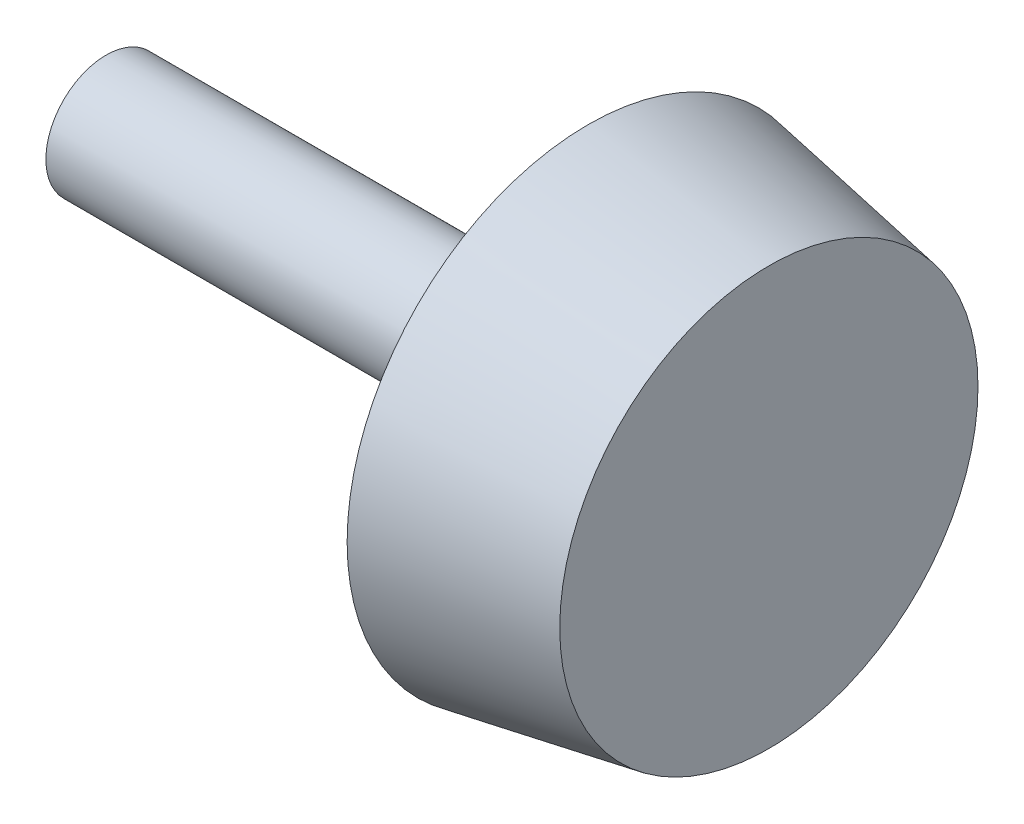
ISO-10303-21;
HEADER;
FILE_DESCRIPTION(('STEP AP214'),'2;1');
FILE_NAME('part.step','',(''),(''),'','','');
FILE_SCHEMA(('AUTOMOTIVE_DESIGN { 1 0 10303 214 1 1 1 1 }'));
ENDSEC;
DATA;
#1=APPLICATION_CONTEXT('core data for automotive mechanical design processes');
#2=APPLICATION_PROTOCOL_DEFINITION('international standard','automotive_design',2000,#1);
#3=PRODUCT_CONTEXT('',#1,'mechanical');
#4=PRODUCT('Part','Part','',(#3));
#5=PRODUCT_RELATED_PRODUCT_CATEGORY('part','',(#4));
#6=PRODUCT_DEFINITION_FORMATION('','',#4);
#7=PRODUCT_DEFINITION_CONTEXT('part definition',#1,'design');
#8=PRODUCT_DEFINITION('design','',#6,#7);
#9=PRODUCT_DEFINITION_SHAPE('','',#8);
#10=(LENGTH_UNIT() NAMED_UNIT(*) SI_UNIT(.MILLI.,.METRE.));
#11=(NAMED_UNIT(*) PLANE_ANGLE_UNIT() SI_UNIT($,.RADIAN.));
#12=(NAMED_UNIT(*) SI_UNIT($,.STERADIAN.) SOLID_ANGLE_UNIT());
#13=UNCERTAINTY_MEASURE_WITH_UNIT(LENGTH_MEASURE(1.E-05),#10,'distance_accuracy_value','');
#14=(GEOMETRIC_REPRESENTATION_CONTEXT(3) GLOBAL_UNCERTAINTY_ASSIGNED_CONTEXT((#13)) GLOBAL_UNIT_ASSIGNED_CONTEXT((#10,
#11,#12)) REPRESENTATION_CONTEXT('',''));
#15=CARTESIAN_POINT('',(0.,0.,0.));
#16=DIRECTION('',(0.,0.,1.));
#17=DIRECTION('',(1.,0.,0.));
#18=AXIS2_PLACEMENT_3D('',#15,#16,#17);
#19=CARTESIAN_POINT('',(25.4,0.,0.));
#20=DIRECTION('',(-1.,0.,0.));
#21=DIRECTION('',(0.,0.,1.));
#22=AXIS2_PLACEMENT_3D('',#19,#20,#21);
#23=CYLINDRICAL_SURFACE('',#22,3.175);
#24=CARTESIAN_POINT('',(25.4,0.,0.));
#25=DIRECTION('',(1.,0.,0.));
#26=DIRECTION('',(0.,0.,-1.));
#27=AXIS2_PLACEMENT_3D('',#24,#25,#26);
#28=CIRCLE('',#27,3.175);
#29=CARTESIAN_POINT('',(25.4,0.,-3.175));
#30=VERTEX_POINT('',#29);
#31=EDGE_CURVE('E10',#30,#30,#28,.T.);
#32=ORIENTED_EDGE('',*,*,#31,.F.);
#33=EDGE_LOOP('',(#32));
#34=FACE_BOUND('',#33,.T.);
#35=CARTESIAN_POINT('',(0.,0.,0.));
#36=DIRECTION('',(1.,0.,0.));
#37=DIRECTION('',(0.,0.,-1.));
#38=AXIS2_PLACEMENT_3D('',#35,#36,#37);
#39=CIRCLE('',#38,3.175);
#40=CARTESIAN_POINT('',(0.,0.,-3.175));
#41=VERTEX_POINT('',#40);
#42=EDGE_CURVE('E32',#41,#41,#39,.T.);
#43=ORIENTED_EDGE('',*,*,#42,.T.);
#44=EDGE_LOOP('',(#43));
#45=FACE_BOUND('',#44,.T.);
#46=ADVANCED_FACE('F29',(#34,#45),#23,.T.);
#47=CARTESIAN_POINT('',(0.,0.,0.));
#48=DIRECTION('',(1.,0.,0.));
#49=DIRECTION('',(0.,0.,-1.));
#50=AXIS2_PLACEMENT_3D('',#47,#48,#49);
#51=PLANE('',#50);
#52=ORIENTED_EDGE('',*,*,#42,.F.);
#53=EDGE_LOOP('',(#52));
#54=FACE_BOUND('',#53,.T.);
#55=ADVANCED_FACE('F51',(#54),#51,.F.);
#56=CARTESIAN_POINT('',(25.4,0.,0.));
#57=DIRECTION('',(1.,0.,0.));
#58=DIRECTION('',(0.,0.,-1.));
#59=AXIS2_PLACEMENT_3D('',#56,#57,#58);
#60=PLANE('',#59);
#61=CARTESIAN_POINT('',(25.4,0.,0.));
#62=DIRECTION('',(1.,0.,0.));
#63=DIRECTION('',(0.,0.,-1.));
#64=AXIS2_PLACEMENT_3D('',#61,#62,#63);
#65=CIRCLE('',#64,12.7);
#66=CARTESIAN_POINT('',(25.4,0.,-12.7));
#67=VERTEX_POINT('',#66);
#68=EDGE_CURVE('E43',#67,#67,#65,.T.);
#69=ORIENTED_EDGE('',*,*,#68,.F.);
#70=EDGE_LOOP('',(#69));
#71=FACE_BOUND('',#70,.T.);
#72=ORIENTED_EDGE('',*,*,#31,.T.);
#73=EDGE_LOOP('',(#72));
#74=FACE_BOUND('',#73,.T.);
#75=ADVANCED_FACE('F49',(#71,#74),#60,.F.);
#76=CARTESIAN_POINT('',(25.4,0.,0.));
#77=DIRECTION('',(-1.,0.,0.));
#78=DIRECTION('',(0.,0.,-1.));
#79=AXIS2_PLACEMENT_3D('',#76,#77,#78);
#80=CONICAL_SURFACE('',#79,12.7,0.174532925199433);
#81=CARTESIAN_POINT('',(34.925,0.,0.));
#82=DIRECTION('',(1.,0.,0.));
#83=DIRECTION('',(0.,0.,-1.));
#84=AXIS2_PLACEMENT_3D('',#81,#82,#83);
#85=CIRCLE('',#84,11.0204855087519);
#86=CARTESIAN_POINT('',(34.925,0.,-11.0204855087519));
#87=VERTEX_POINT('',#86);
#88=EDGE_CURVE('E39',#87,#87,#85,.T.);
#89=ORIENTED_EDGE('',*,*,#88,.F.);
#90=EDGE_LOOP('',(#89));
#91=FACE_BOUND('',#90,.T.);
#92=ORIENTED_EDGE('',*,*,#68,.T.);
#93=EDGE_LOOP('',(#92));
#94=FACE_BOUND('',#93,.T.);
#95=ADVANCED_FACE('F47',(#91,#94),#80,.T.);
#96=CARTESIAN_POINT('',(34.925,0.,0.));
#97=DIRECTION('',(1.,0.,0.));
#98=DIRECTION('',(0.,0.,-1.));
#99=AXIS2_PLACEMENT_3D('',#96,#97,#98);
#100=PLANE('',#99);
#101=ORIENTED_EDGE('',*,*,#88,.T.);
#102=EDGE_LOOP('',(#101));
#103=FACE_BOUND('',#102,.T.);
#104=ADVANCED_FACE('F57',(#103),#100,.T.);
#105=CLOSED_SHELL('',(#46,#55,#75,#95,#104));
#106=MANIFOLD_SOLID_BREP('B2',#105);
#107=ADVANCED_BREP_SHAPE_REPRESENTATION('',(#18,#106),#14);
#108=SHAPE_DEFINITION_REPRESENTATION(#9,#107);
ENDSEC;
END-ISO-10303-21;
